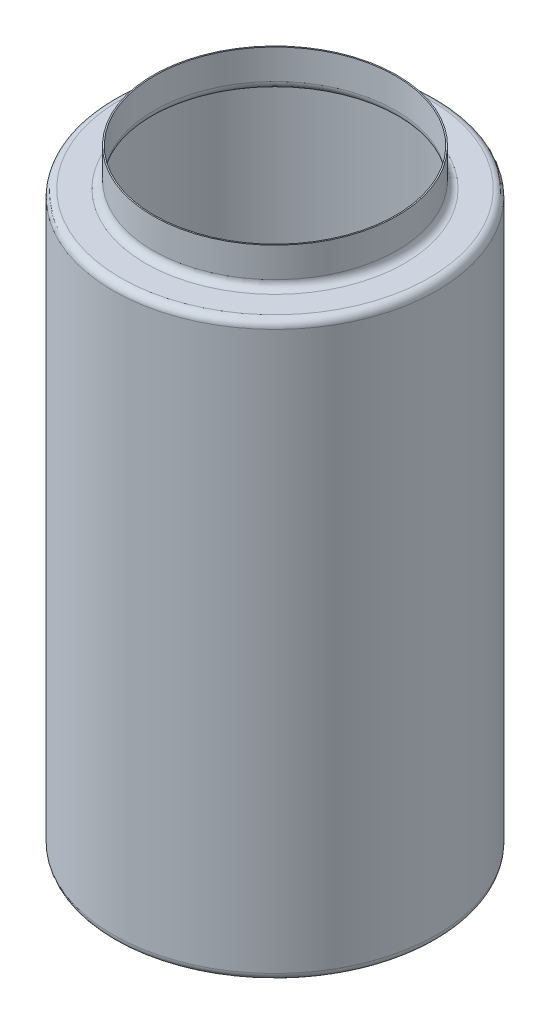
from build123d import *

# Parameters (mm, degrees)
ESQUISSE1_R      = 65
EXTRUSION1_DEPTH = 230
ESQUISSE2_R      = 49
EXTRUSION2_DEPTH = 15
CONG_1_R         = 3
COQUE1_T         = -0.5


with BuildPart() as part:
    # Esquisse1 → Extrusion1 (new body)
    with BuildSketch(Plane(origin=(0, 0, 0), x_dir=(1, 0, 0), z_dir=(0, 1, 0))):
        with Locations(Location((0, 0, 0), (0, 0, 270))):
            Circle(ESQUISSE1_R)
    extrude(amount=EXTRUSION1_DEPTH)

    # Esquisse2 → Extrusion2 (add)
    with BuildSketch(Plane(origin=(0, 230, 0), x_dir=(1, 0, 0), z_dir=(0, 1, 0))):
        with Locations(Location((0, 0, 0), (0, 0, 270))):
            Circle(ESQUISSE2_R)
    extrude(amount=EXTRUSION2_DEPTH)

    # Cong_1
    cong_1_edges = [part.edges().sort_by_distance(p)[0] for p in [
        (0, 0, -65),
        (0, 230, -65),
        (0, 230, -49),
    ]]
    fillet(cong_1_edges, radius=CONG_1_R)

    # Coque1
    coque1_openings = [part.faces().sort_by_distance(p)[0] for p in [
        (0, 245, 0),
    ]]
    offset(amount=COQUE1_T, openings=coque1_openings, kind=Kind.INTERSECTION)


solid = part.part
